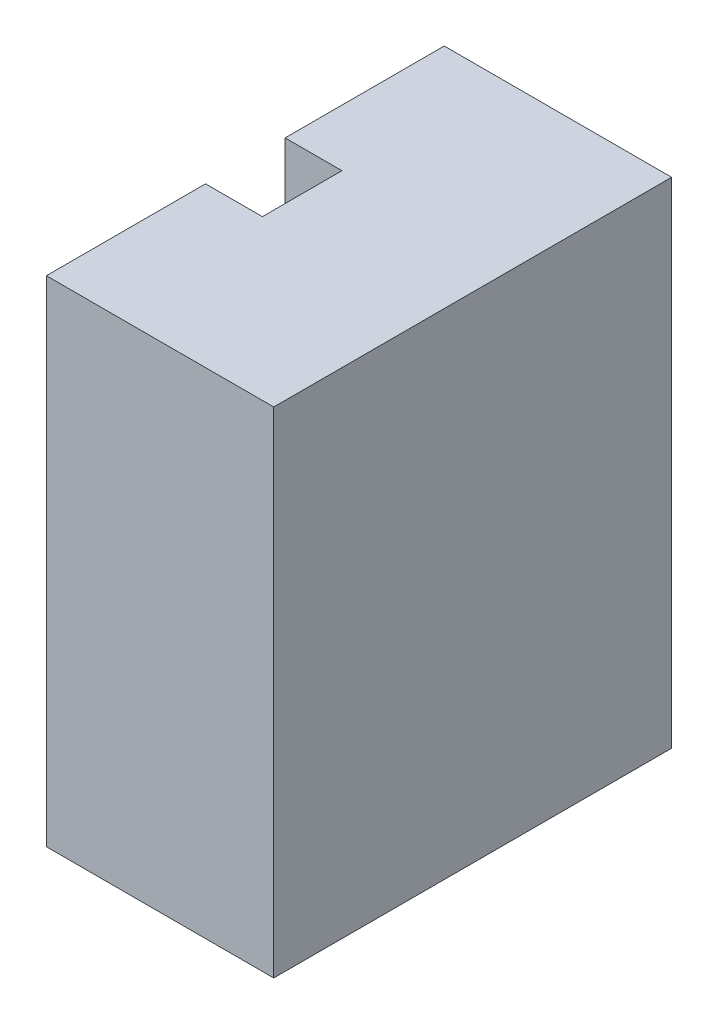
ISO-10303-21;
HEADER;
FILE_DESCRIPTION(('STEP AP214'),'2;1');
FILE_NAME('part.step','',(''),(''),'','','');
FILE_SCHEMA(('AUTOMOTIVE_DESIGN { 1 0 10303 214 1 1 1 1 }'));
ENDSEC;
DATA;
#1=APPLICATION_CONTEXT('core data for automotive mechanical design processes');
#2=APPLICATION_PROTOCOL_DEFINITION('international standard','automotive_design',2000,#1);
#3=PRODUCT_CONTEXT('',#1,'mechanical');
#4=PRODUCT('Part','Part','',(#3));
#5=PRODUCT_RELATED_PRODUCT_CATEGORY('part','',(#4));
#6=PRODUCT_DEFINITION_FORMATION('','',#4);
#7=PRODUCT_DEFINITION_CONTEXT('part definition',#1,'design');
#8=PRODUCT_DEFINITION('design','',#6,#7);
#9=PRODUCT_DEFINITION_SHAPE('','',#8);
#10=(LENGTH_UNIT() NAMED_UNIT(*) SI_UNIT(.MILLI.,.METRE.));
#11=(NAMED_UNIT(*) PLANE_ANGLE_UNIT() SI_UNIT($,.RADIAN.));
#12=(NAMED_UNIT(*) SI_UNIT($,.STERADIAN.) SOLID_ANGLE_UNIT());
#13=UNCERTAINTY_MEASURE_WITH_UNIT(LENGTH_MEASURE(1.E-05),#10,'distance_accuracy_value','');
#14=(GEOMETRIC_REPRESENTATION_CONTEXT(3) GLOBAL_UNCERTAINTY_ASSIGNED_CONTEXT((#13)) GLOBAL_UNIT_ASSIGNED_CONTEXT((#10,
#11,#12)) REPRESENTATION_CONTEXT('',''));
#15=CARTESIAN_POINT('',(0.,0.,0.));
#16=DIRECTION('',(0.,0.,1.));
#17=DIRECTION('',(1.,0.,0.));
#18=AXIS2_PLACEMENT_3D('',#15,#16,#17);
#19=CARTESIAN_POINT('',(10.,65.,0.));
#20=DIRECTION('',(0.,1.,0.));
#21=DIRECTION('',(0.,0.,1.));
#22=AXIS2_PLACEMENT_3D('',#19,#20,#21);
#23=PLANE('',#22);
#24=DIRECTION('',(-1.,0.,0.));
#25=VECTOR('',#24,1.);
#26=CARTESIAN_POINT('',(10.,65.,-7.00000000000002));
#27=LINE('',#26,#25);
#28=CARTESIAN_POINT('',(10.,65.,-7.00000000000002));
#29=VERTEX_POINT('',#28);
#30=CARTESIAN_POINT('',(9.74679434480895,65.,-7.00000000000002));
#31=VERTEX_POINT('',#30);
#32=EDGE_CURVE('E176',#29,#31,#27,.T.);
#33=ORIENTED_EDGE('',*,*,#32,.T.);
#34=CARTESIAN_POINT('',(0.,65.,0.));
#35=DIRECTION('',(0.,-1.,0.));
#36=DIRECTION('',(0.,0.,-1.));
#37=AXIS2_PLACEMENT_3D('',#34,#35,#36);
#38=CIRCLE('',#37,12.);
#39=CARTESIAN_POINT('',(10.,65.,-6.6332495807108));
#40=VERTEX_POINT('',#39);
#41=EDGE_CURVE('E402',#31,#40,#38,.T.);
#42=ORIENTED_EDGE('',*,*,#41,.T.);
#43=DIRECTION('',(0.,0.,-1.));
#44=VECTOR('',#43,1.);
#45=CARTESIAN_POINT('',(10.,65.,0.));
#46=LINE('',#45,#44);
#47=EDGE_CURVE('E173',#40,#29,#46,.T.);
#48=ORIENTED_EDGE('',*,*,#47,.T.);
#49=EDGE_LOOP('',(#33,#42,#48));
#50=FACE_BOUND('',#49,.T.);
#51=ADVANCED_FACE('F43',(#50),#23,.T.);
#52=CARTESIAN_POINT('',(10.,65.,7.00000000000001));
#53=VERTEX_POINT('',#52);
#54=CARTESIAN_POINT('',(10.,65.,6.6332495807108));
#55=VERTEX_POINT('',#54);
#56=EDGE_CURVE('E174',#53,#55,#46,.T.);
#57=ORIENTED_EDGE('',*,*,#56,.T.);
#58=CARTESIAN_POINT('',(9.74679434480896,65.,7.00000000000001));
#59=VERTEX_POINT('',#58);
#60=EDGE_CURVE('E414',#55,#59,#38,.T.);
#61=ORIENTED_EDGE('',*,*,#60,.T.);
#62=DIRECTION('',(-1.,0.,0.));
#63=VECTOR('',#62,1.);
#64=CARTESIAN_POINT('',(10.,65.,7.00000000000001));
#65=LINE('',#64,#63);
#66=EDGE_CURVE('E182',#53,#59,#65,.T.);
#67=ORIENTED_EDGE('',*,*,#66,.F.);
#68=EDGE_LOOP('',(#57,#61,#67));
#69=FACE_BOUND('',#68,.T.);
#70=ADVANCED_FACE('F232',(#69),#23,.T.);
#71=CARTESIAN_POINT('',(40.,75.,0.));
#72=DIRECTION('',(0.,1.,0.));
#73=DIRECTION('',(0.,0.,1.));
#74=AXIS2_PLACEMENT_3D('',#71,#72,#73);
#75=PLANE('',#74);
#76=DIRECTION('',(-1.,0.,0.));
#77=VECTOR('',#76,1.);
#78=CARTESIAN_POINT('',(10.,75.,-7.00000000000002));
#79=LINE('',#78,#77);
#80=CARTESIAN_POINT('',(10.,75.,-7.00000000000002));
#81=VERTEX_POINT('',#80);
#82=CARTESIAN_POINT('',(0.,75.,-7.00000000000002));
#83=VERTEX_POINT('',#82);
#84=EDGE_CURVE('E189',#81,#83,#79,.T.);
#85=ORIENTED_EDGE('',*,*,#84,.F.);
#86=DIRECTION('',(0.,0.,-1.));
#87=VECTOR('',#86,1.);
#88=CARTESIAN_POINT('',(10.,75.,0.));
#89=LINE('',#88,#87);
#90=CARTESIAN_POINT('',(10.,75.,7.00000000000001));
#91=VERTEX_POINT('',#90);
#92=EDGE_CURVE('E168',#91,#81,#89,.T.);
#93=ORIENTED_EDGE('',*,*,#92,.F.);
#94=DIRECTION('',(-1.,0.,0.));
#95=VECTOR('',#94,1.);
#96=CARTESIAN_POINT('',(10.,75.,7.00000000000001));
#97=LINE('',#96,#95);
#98=CARTESIAN_POINT('',(0.,75.,7.00000000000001));
#99=VERTEX_POINT('',#98);
#100=EDGE_CURVE('E186',#91,#99,#97,.T.);
#101=ORIENTED_EDGE('',*,*,#100,.T.);
#102=DIRECTION('',(0.,0.,-1.));
#103=VECTOR('',#102,1.);
#104=CARTESIAN_POINT('',(0.,75.,0.));
#105=LINE('',#104,#103);
#106=CARTESIAN_POINT('',(0.,75.,35.));
#107=VERTEX_POINT('',#106);
#108=EDGE_CURVE('E200',#107,#99,#105,.T.);
#109=ORIENTED_EDGE('',*,*,#108,.F.);
#110=DIRECTION('',(-1.,0.,0.));
#111=VECTOR('',#110,1.);
#112=CARTESIAN_POINT('',(40.,75.,35.));
#113=LINE('',#112,#111);
#114=CARTESIAN_POINT('',(40.,75.,35.));
#115=VERTEX_POINT('',#114);
#116=EDGE_CURVE('E11',#115,#107,#113,.T.);
#117=ORIENTED_EDGE('',*,*,#116,.F.);
#118=DIRECTION('',(0.,0.,-1.));
#119=VECTOR('',#118,1.);
#120=CARTESIAN_POINT('',(40.,75.,0.));
#121=LINE('',#120,#119);
#122=CARTESIAN_POINT('',(40.,75.,-35.));
#123=VERTEX_POINT('',#122);
#124=EDGE_CURVE('E191',#115,#123,#121,.T.);
#125=ORIENTED_EDGE('',*,*,#124,.T.);
#126=DIRECTION('',(-1.,0.,0.));
#127=VECTOR('',#126,1.);
#128=CARTESIAN_POINT('',(40.,75.,-35.));
#129=LINE('',#128,#127);
#130=CARTESIAN_POINT('',(0.,75.,-35.));
#131=VERTEX_POINT('',#130);
#132=EDGE_CURVE('E67',#123,#131,#129,.T.);
#133=ORIENTED_EDGE('',*,*,#132,.T.);
#134=EDGE_CURVE('E89',#83,#131,#105,.T.);
#135=ORIENTED_EDGE('',*,*,#134,.F.);
#136=EDGE_LOOP('',(#85,#93,#101,#109,#117,#125,#133,#135));
#137=FACE_BOUND('',#136,.T.);
#138=ADVANCED_FACE('F45',(#137),#75,.T.);
#139=CARTESIAN_POINT('',(40.,0.,35.));
#140=DIRECTION('',(0.,0.,-1.));
#141=DIRECTION('',(-1.,0.,0.));
#142=AXIS2_PLACEMENT_3D('',#139,#140,#141);
#143=PLANE('',#142);
#144=DIRECTION('',(0.,-1.,0.));
#145=VECTOR('',#144,1.);
#146=CARTESIAN_POINT('',(0.,0.,35.));
#147=LINE('',#146,#145);
#148=CARTESIAN_POINT('',(0.,-12.,35.));
#149=VERTEX_POINT('',#148);
#150=EDGE_CURVE('E203',#107,#149,#147,.T.);
#151=ORIENTED_EDGE('',*,*,#150,.T.);
#152=DIRECTION('',(-1.,0.,0.));
#153=VECTOR('',#152,1.);
#154=CARTESIAN_POINT('',(40.,-12.,35.));
#155=LINE('',#154,#153);
#156=CARTESIAN_POINT('',(40.,-12.,35.));
#157=VERTEX_POINT('',#156);
#158=EDGE_CURVE('E51',#157,#149,#155,.T.);
#159=ORIENTED_EDGE('',*,*,#158,.F.);
#160=DIRECTION('',(0.,-1.,0.));
#161=VECTOR('',#160,1.);
#162=CARTESIAN_POINT('',(40.,0.,35.));
#163=LINE('',#162,#161);
#164=EDGE_CURVE('E193',#115,#157,#163,.T.);
#165=ORIENTED_EDGE('',*,*,#164,.F.);
#166=ORIENTED_EDGE('',*,*,#116,.T.);
#167=EDGE_LOOP('',(#151,#159,#165,#166));
#168=FACE_BOUND('',#167,.T.);
#169=ADVANCED_FACE('F225',(#168),#143,.F.);
#170=CARTESIAN_POINT('',(40.,-12.,0.));
#171=DIRECTION('',(0.,1.,0.));
#172=DIRECTION('',(0.,0.,1.));
#173=AXIS2_PLACEMENT_3D('',#170,#171,#172);
#174=PLANE('',#173);
#175=DIRECTION('',(0.,0.,-1.));
#176=VECTOR('',#175,1.);
#177=CARTESIAN_POINT('',(0.,-12.,0.));
#178=LINE('',#177,#176);
#179=CARTESIAN_POINT('',(0.,-12.,-35.));
#180=VERTEX_POINT('',#179);
#181=EDGE_CURVE('E205',#149,#180,#178,.T.);
#182=ORIENTED_EDGE('',*,*,#181,.T.);
#183=DIRECTION('',(-1.,0.,0.));
#184=VECTOR('',#183,1.);
#185=CARTESIAN_POINT('',(40.,-12.,-35.));
#186=LINE('',#185,#184);
#187=CARTESIAN_POINT('',(40.,-12.,-35.));
#188=VERTEX_POINT('',#187);
#189=EDGE_CURVE('E210',#188,#180,#186,.T.);
#190=ORIENTED_EDGE('',*,*,#189,.F.);
#191=DIRECTION('',(0.,0.,-1.));
#192=VECTOR('',#191,1.);
#193=CARTESIAN_POINT('',(40.,-12.,0.));
#194=LINE('',#193,#192);
#195=EDGE_CURVE('E196',#157,#188,#194,.T.);
#196=ORIENTED_EDGE('',*,*,#195,.F.);
#197=ORIENTED_EDGE('',*,*,#158,.T.);
#198=EDGE_LOOP('',(#182,#190,#196,#197));
#199=FACE_BOUND('',#198,.T.);
#200=ADVANCED_FACE('F216',(#199),#174,.F.);
#201=CARTESIAN_POINT('',(40.,0.,-35.));
#202=DIRECTION('',(0.,0.,-1.));
#203=DIRECTION('',(-1.,0.,0.));
#204=AXIS2_PLACEMENT_3D('',#201,#202,#203);
#205=PLANE('',#204);
#206=DIRECTION('',(0.,-1.,0.));
#207=VECTOR('',#206,1.);
#208=CARTESIAN_POINT('',(0.,0.,-35.));
#209=LINE('',#208,#207);
#210=EDGE_CURVE('E194',#131,#180,#209,.T.);
#211=ORIENTED_EDGE('',*,*,#210,.F.);
#212=ORIENTED_EDGE('',*,*,#132,.F.);
#213=DIRECTION('',(0.,-1.,0.));
#214=VECTOR('',#213,1.);
#215=CARTESIAN_POINT('',(40.,0.,-35.));
#216=LINE('',#215,#214);
#217=EDGE_CURVE('E198',#123,#188,#216,.T.);
#218=ORIENTED_EDGE('',*,*,#217,.T.);
#219=ORIENTED_EDGE('',*,*,#189,.T.);
#220=EDGE_LOOP('',(#211,#212,#218,#219));
#221=FACE_BOUND('',#220,.T.);
#222=ADVANCED_FACE('F220',(#221),#205,.T.);
#223=CARTESIAN_POINT('',(40.,0.,0.));
#224=DIRECTION('',(1.,0.,0.));
#225=DIRECTION('',(0.,0.,-1.));
#226=AXIS2_PLACEMENT_3D('',#223,#224,#225);
#227=PLANE('',#226);
#228=ORIENTED_EDGE('',*,*,#124,.F.);
#229=ORIENTED_EDGE('',*,*,#164,.T.);
#230=ORIENTED_EDGE('',*,*,#195,.T.);
#231=ORIENTED_EDGE('',*,*,#217,.F.);
#232=EDGE_LOOP('',(#228,#229,#230,#231));
#233=FACE_BOUND('',#232,.T.);
#234=ADVANCED_FACE('F224',(#233),#227,.T.);
#235=CARTESIAN_POINT('',(0.,0.,0.));
#236=DIRECTION('',(1.,0.,0.));
#237=DIRECTION('',(0.,0.,-1.));
#238=AXIS2_PLACEMENT_3D('',#235,#236,#237);
#239=PLANE('',#238);
#240=CARTESIAN_POINT('',(0.,0.,0.));
#241=CARTESIAN_POINT('',(0.,0.,-13.8871801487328));
#242=CARTESIAN_POINT('',(0.,6.85908766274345,-24.7881747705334));
#243=CARTESIAN_POINT('',(0.,25.38979208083,-32.0384031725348));
#244=CARTESIAN_POINT('',(0.,43.5951288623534,-29.0632046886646));
#245=CARTESIAN_POINT('',(0.,55.7709297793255,-11.2484672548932));
#246=CARTESIAN_POINT('',(0.,65.,-12.));
#247=B_SPLINE_CURVE_WITH_KNOTS('',3,(#240,#241,#242,#243,#244,#245,#246),.UNSPECIFIED.,.F.,.F.,
(4,1,1,1,4),(0.,0.328628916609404,0.396262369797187,0.645215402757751,1.),.UNSPECIFIED.);
#248=CARTESIAN_POINT('',(0.,0.,0.));
#249=VERTEX_POINT('',#248);
#250=CARTESIAN_POINT('',(0.,65.,-12.));
#251=VERTEX_POINT('',#250);
#252=EDGE_CURVE('E138',#249,#251,#247,.T.);
#253=ORIENTED_EDGE('',*,*,#252,.T.);
#254=DIRECTION('',(0.,0.,1.));
#255=VECTOR('',#254,1.);
#256=CARTESIAN_POINT('',(0.,65.,0.));
#257=LINE('',#256,#255);
#258=CARTESIAN_POINT('',(0.,65.,-7.00000000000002));
#259=VERTEX_POINT('',#258);
#260=EDGE_CURVE('E403',#251,#259,#257,.T.);
#261=ORIENTED_EDGE('',*,*,#260,.T.);
#262=DIRECTION('',(0.,-1.,0.));
#263=VECTOR('',#262,1.);
#264=CARTESIAN_POINT('',(0.,0.,-7.00000000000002));
#265=LINE('',#264,#263);
#266=EDGE_CURVE('E151',#83,#259,#265,.T.);
#267=ORIENTED_EDGE('',*,*,#266,.F.);
#268=ORIENTED_EDGE('',*,*,#134,.T.);
#269=ORIENTED_EDGE('',*,*,#210,.T.);
#270=ORIENTED_EDGE('',*,*,#181,.F.);
#271=ORIENTED_EDGE('',*,*,#150,.F.);
#272=ORIENTED_EDGE('',*,*,#108,.T.);
#273=DIRECTION('',(0.,-1.,0.));
#274=VECTOR('',#273,1.);
#275=CARTESIAN_POINT('',(0.,0.,7.00000000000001));
#276=LINE('',#275,#274);
#277=CARTESIAN_POINT('',(0.,65.,7.00000000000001));
#278=VERTEX_POINT('',#277);
#279=EDGE_CURVE('E154',#99,#278,#276,.T.);
#280=ORIENTED_EDGE('',*,*,#279,.T.);
#281=CARTESIAN_POINT('',(0.,65.,12.));
#282=VERTEX_POINT('',#281);
#283=EDGE_CURVE('E150',#278,#282,#257,.T.);
#284=ORIENTED_EDGE('',*,*,#283,.T.);
#285=CARTESIAN_POINT('',(0.,0.,0.));
#286=CARTESIAN_POINT('',(0.,0.,13.8871801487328));
#287=CARTESIAN_POINT('',(0.,6.85908766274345,24.7881747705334));
#288=CARTESIAN_POINT('',(0.,25.38979208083,32.0384031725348));
#289=CARTESIAN_POINT('',(0.,43.5951288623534,29.0632046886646));
#290=CARTESIAN_POINT('',(0.,55.7709297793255,11.2484672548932));
#291=CARTESIAN_POINT('',(0.,65.,12.));
#292=B_SPLINE_CURVE_WITH_KNOTS('',3,(#285,#286,#287,#288,#289,#290,#291),.UNSPECIFIED.,.F.,.F.,
(4,1,1,1,4),(0.,0.328628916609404,0.396262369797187,0.645215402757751,1.),.UNSPECIFIED.);
#293=EDGE_CURVE('E141',#282,#249,#292,.F.);
#294=ORIENTED_EDGE('',*,*,#293,.T.);
#295=EDGE_LOOP('',(#253,#261,#267,#268,#269,#270,#271,#272,#280,#284,#294));
#296=FACE_BOUND('',#295,.T.);
#297=ADVANCED_FACE('F148',(#296),#239,.F.);
#298=CARTESIAN_POINT('',(10.,0.,-7.00000000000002));
#299=DIRECTION('',(0.,0.,-1.));
#300=DIRECTION('',(-1.,0.,0.));
#301=AXIS2_PLACEMENT_3D('',#298,#299,#300);
#302=PLANE('',#301);
#303=ORIENTED_EDGE('',*,*,#266,.T.);
#304=EDGE_CURVE('E183',#31,#259,#27,.T.);
#305=ORIENTED_EDGE('',*,*,#304,.F.);
#306=ORIENTED_EDGE('',*,*,#32,.F.);
#307=DIRECTION('',(0.,-1.,0.));
#308=VECTOR('',#307,1.);
#309=CARTESIAN_POINT('',(10.,0.,-7.00000000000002));
#310=LINE('',#309,#308);
#311=EDGE_CURVE('E162',#81,#29,#310,.T.);
#312=ORIENTED_EDGE('',*,*,#311,.F.);
#313=ORIENTED_EDGE('',*,*,#84,.T.);
#314=EDGE_LOOP('',(#303,#305,#306,#312,#313));
#315=FACE_BOUND('',#314,.T.);
#316=ADVANCED_FACE('F247',(#315),#302,.F.);
#317=CARTESIAN_POINT('',(10.,0.,7.00000000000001));
#318=DIRECTION('',(0.,0.,-1.));
#319=DIRECTION('',(-1.,0.,0.));
#320=AXIS2_PLACEMENT_3D('',#317,#318,#319);
#321=PLANE('',#320);
#322=ORIENTED_EDGE('',*,*,#279,.F.);
#323=ORIENTED_EDGE('',*,*,#100,.F.);
#324=DIRECTION('',(0.,-1.,0.));
#325=VECTOR('',#324,1.);
#326=CARTESIAN_POINT('',(10.,0.,7.00000000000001));
#327=LINE('',#326,#325);
#328=EDGE_CURVE('E171',#91,#53,#327,.T.);
#329=ORIENTED_EDGE('',*,*,#328,.T.);
#330=ORIENTED_EDGE('',*,*,#66,.T.);
#331=EDGE_CURVE('E146',#59,#278,#65,.T.);
#332=ORIENTED_EDGE('',*,*,#331,.T.);
#333=EDGE_LOOP('',(#322,#323,#329,#330,#332));
#334=FACE_BOUND('',#333,.T.);
#335=ADVANCED_FACE('F244',(#334),#321,.T.);
#336=CARTESIAN_POINT('',(10.,0.,0.));
#337=DIRECTION('',(1.,0.,0.));
#338=DIRECTION('',(0.,0.,-1.));
#339=AXIS2_PLACEMENT_3D('',#336,#337,#338);
#340=PLANE('',#339);
#341=ORIENTED_EDGE('',*,*,#311,.T.);
#342=ORIENTED_EDGE('',*,*,#47,.F.);
#343=EDGE_CURVE('E177',#55,#40,#46,.T.);
#344=ORIENTED_EDGE('',*,*,#343,.F.);
#345=ORIENTED_EDGE('',*,*,#56,.F.);
#346=ORIENTED_EDGE('',*,*,#328,.F.);
#347=ORIENTED_EDGE('',*,*,#92,.T.);
#348=EDGE_LOOP('',(#341,#342,#344,#345,#346,#347));
#349=FACE_BOUND('',#348,.T.);
#350=ADVANCED_FACE('F242',(#349),#340,.F.);
#351=CARTESIAN_POINT('',(0.,0.,0.));
#352=CARTESIAN_POINT('',(13.8871801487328,0.,0.));
#353=CARTESIAN_POINT('',(24.7881747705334,6.85908766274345,0.));
#354=CARTESIAN_POINT('',(32.0384031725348,25.38979208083,0.));
#355=CARTESIAN_POINT('',(29.0632046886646,43.5951288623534,0.));
#356=CARTESIAN_POINT('',(11.2484672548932,55.7709297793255,0.));
#357=CARTESIAN_POINT('',(12.,65.,0.));
#358=B_SPLINE_CURVE_WITH_KNOTS('',3,(#351,#352,#353,#354,#355,#356,#357),.UNSPECIFIED.,.F.,.F.,
(4,1,1,1,4),(0.,0.328628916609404,0.396262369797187,0.645215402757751,1.),.UNSPECIFIED.);
#359=CARTESIAN_POINT('',(0.,0.,0.));
#360=DIRECTION('',(0.,-1.,0.));
#361=AXIS1_PLACEMENT('',#359,#360);
#362=SURFACE_OF_REVOLUTION('',#358,#361);
#363=EDGE_CURVE('E58',#59,#282,#38,.T.);
#364=ORIENTED_EDGE('',*,*,#363,.F.);
#365=ORIENTED_EDGE('',*,*,#60,.F.);
#366=EDGE_CURVE('E417',#40,#55,#38,.T.);
#367=ORIENTED_EDGE('',*,*,#366,.F.);
#368=ORIENTED_EDGE('',*,*,#41,.F.);
#369=EDGE_CURVE('E144',#251,#31,#38,.T.);
#370=ORIENTED_EDGE('',*,*,#369,.F.);
#371=ORIENTED_EDGE('',*,*,#252,.F.);
#372=ORIENTED_EDGE('',*,*,#293,.F.);
#373=EDGE_LOOP('',(#364,#365,#367,#368,#370,#371,#372));
#374=FACE_BOUND('',#373,.T.);
#375=ADVANCED_FACE('F140',(#374),#362,.T.);
#376=CARTESIAN_POINT('',(12.,65.,0.));
#377=DIRECTION('',(0.,1.,0.));
#378=DIRECTION('',(0.,0.,1.));
#379=AXIS2_PLACEMENT_3D('',#376,#377,#378);
#380=PLANE('',#379);
#381=ORIENTED_EDGE('',*,*,#363,.T.);
#382=ORIENTED_EDGE('',*,*,#283,.F.);
#383=ORIENTED_EDGE('',*,*,#331,.F.);
#384=EDGE_LOOP('',(#381,#382,#383));
#385=FACE_BOUND('',#384,.T.);
#386=ADVANCED_FACE('F291',(#385),#380,.F.);
#387=ORIENTED_EDGE('',*,*,#343,.T.);
#388=ORIENTED_EDGE('',*,*,#366,.T.);
#389=EDGE_LOOP('',(#387,#388));
#390=FACE_BOUND('',#389,.T.);
#391=ADVANCED_FACE('F297',(#390),#380,.F.);
#392=ORIENTED_EDGE('',*,*,#304,.T.);
#393=ORIENTED_EDGE('',*,*,#260,.F.);
#394=ORIENTED_EDGE('',*,*,#369,.T.);
#395=EDGE_LOOP('',(#392,#393,#394));
#396=FACE_BOUND('',#395,.T.);
#397=ADVANCED_FACE('F299',(#396),#380,.F.);
#398=CLOSED_SHELL('',(#51,#70,#138,#169,#200,#222,#234,#297,#316,#335,#350,#375,#386,#391,#397));
#399=MANIFOLD_SOLID_BREP('B2',#398);
#400=ADVANCED_BREP_SHAPE_REPRESENTATION('',(#18,#399),#14);
#401=SHAPE_DEFINITION_REPRESENTATION(#9,#400);
ENDSEC;
END-ISO-10303-21;
